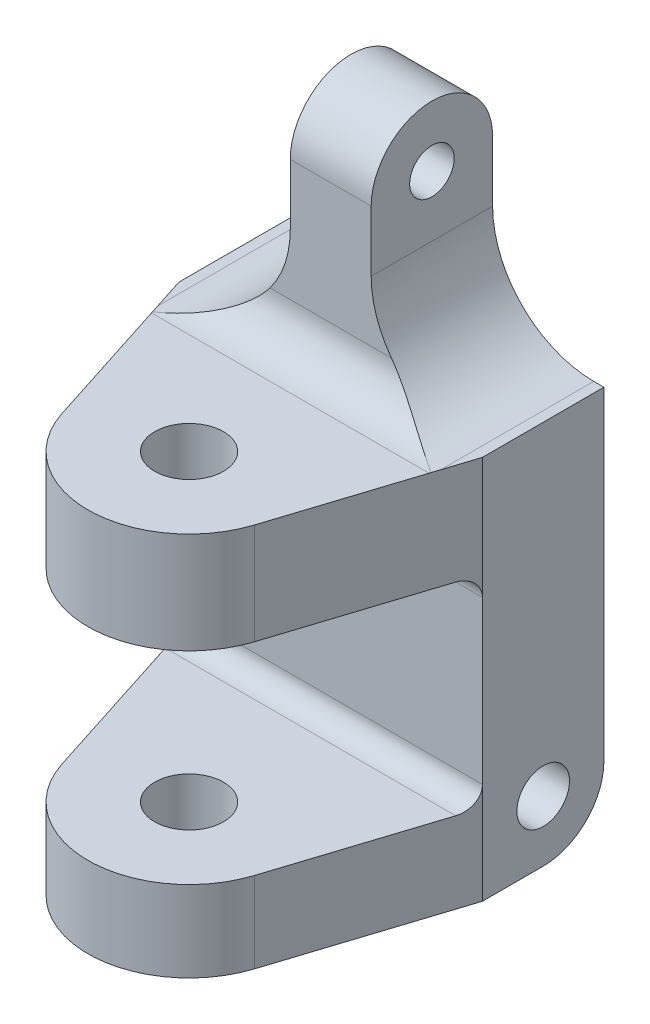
from build123d import *

# Parameters (mm, degrees)
BOSS_EXTRUDE1_DEPTH      = 9.525
BOSS_EXTRUDE6_DEPTH      = 15.24
BOSS_EXTRUDE6_DEPTH_BACK = 19.05
CUT_EXTRUDE1_DEPTH       = 29.575
CUT_EXTRUDE1_DEPTH_BACK  = 29.575
SKETCH9_R                = 1.397
SKETCH9_R_2              = 1.651
CUT_EXTRUDE2_DEPTH       = 33.995567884
SKETCH10_R               = 2.159
CUT_EXTRUDE3_DEPTH       = 33.18516778
CUT_EXTRUDE4_DEPTH       = 27.189420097
CUT_EXTRUDE4_DEPTH_BACK  = 27.189420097


with BuildPart() as part:
    # Sketch1 → Boss-Extrude1 (new, symmetric)
    with BuildSketch(Plane(origin=(0, 0, 0), x_dir=(0, 0, -1), z_dir=(1, 0, 0))):
        with BuildLine():
            Line((3.81, 15.24), (3.81, -15.24))
            ThreePointArc((3.81, -15.24), (0, -19.05), (-3.81, -15.24))
            Line((-3.81, -15.24), (-3.81, 15.24))
            ThreePointArc((-3.81, 15.24), (0, 19.05), (3.81, 15.24))
        make_face()
    extrude(amount=BOSS_EXTRUDE1_DEPTH, both=True)

    # Sketch7 → Boss-Extrude6 (add, two sides: drawn at the far end of the back side and taken through both)
    with BuildSketch(Plane(origin=(0, 0, 0), x_dir=(1, 0, 0), z_dir=(0, 1, 0)).offset(-BOSS_EXTRUDE6_DEPTH_BACK)):
        with BuildLine():
            Line((9.525, -3.81), (6.045782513, -14.641909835))
            ThreePointArc((6.045782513, -14.641909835), (3.741080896, -17.830966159), (0, -19.05))
            ThreePointArc((0, -19.05), (-3.741080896, -17.830966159), (-6.045782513, -14.641909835))
            Line((-6.045782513, -14.641909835), (-9.525, -3.81))
            Line((-9.525, -3.81), (-9.525, 0))
            Line((-9.525, 0), (9.525, 0))
            Line((9.525, 0), (9.525, -3.81))
        make_face()
    extrude(amount=BOSS_EXTRUDE6_DEPTH + BOSS_EXTRUDE6_DEPTH_BACK)

    # Sketch8 → Cut-Extrude1 (cut, two sides: drawn at the far end of the back side and taken through both)
    with BuildSketch(Plane(origin=(0, 0, 0), x_dir=(0, 0, -1), z_dir=(1, 0, 0)).offset(-CUT_EXTRUDE1_DEPTH_BACK)):
        with BuildLine():
            Line((-38.102695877, -13.97), (-5.08, -13.97))
            ThreePointArc((-5.08, -13.97), (-4.181974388, -13.598025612), (-3.81, -12.7))
            Line((-3.81, -12.7), (-3.81, -2.54))
            ThreePointArc((-3.81, -2.54), (-4.181974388, -1.641974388), (-5.08, -1.27))
            Line((-5.08, -1.27), (-38.102695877, -1.27))
            Line((-38.102695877, -1.27), (-38.102695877, -13.97))
        make_face()
        with BuildLine():
            Line((-38.102695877, 5.08), (-6.35, 5.08))
            ThreePointArc((-6.35, 5.08), (-4.553948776, 5.823948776), (-3.81, 7.62))
            Line((-3.81, 7.62), (-3.81, 18.584898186))
            Line((-3.81, 18.584898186), (-38.102695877, 18.584898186))
            Line((-38.102695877, 18.584898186), (-38.102695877, 5.08))
        make_face()
    extrude(amount=CUT_EXTRUDE1_DEPTH + CUT_EXTRUDE1_DEPTH_BACK, mode=Mode.SUBTRACT)

    # Sketch9 → Cut-Extrude2 (cut, through all)
    with BuildSketch(Plane.ZY.offset(9.525)):
        with Locations((0, 15.24)):
            Circle(SKETCH9_R)
        with Locations((0, -15.24)):
            Circle(SKETCH9_R_2)
    extrude(amount=-CUT_EXTRUDE2_DEPTH, mode=Mode.SUBTRACT)

    # Sketch10 → Cut-Extrude3 (cut, through all)
    with BuildSketch(Plane(origin=(0, 5.08, 0), x_dir=(1, 0, 0), z_dir=(0, 1, 0))):
        with Locations(Location((0, -12.7, 0), (0, 0, 270))):
            Circle(SKETCH10_R)
    extrude(amount=-CUT_EXTRUDE3_DEPTH, mode=Mode.SUBTRACT)

    # Sketch13 → Cut-Extrude4 (cut, two sides: drawn at the far end of the back side and taken through both)
    with BuildSketch(Plane.XY.offset(3.81).offset(-CUT_EXTRUDE4_DEPTH_BACK)):
        with BuildLine():
            Line((-2.54, 19.05), (-2.54, 11.43))
            ThreePointArc((-2.54, 11.43), (-4.399871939, 6.939871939), (-8.89, 5.08))
            Line((-8.89, 5.08), (-10.957716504, 5.08))
            Line((-10.957716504, 5.08), (-10.957716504, 19.05))
            Line((-10.957716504, 19.05), (-2.54, 19.05))
        make_face()
        with BuildLine():
            Line((10.957716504, 19.05), (2.54, 19.05))
            Line((2.54, 19.05), (2.54, 11.43))
            ThreePointArc((2.54, 11.43), (4.399871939, 6.939871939), (8.89, 5.08))
            Line((8.89, 5.08), (10.957716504, 5.08))
            Line((10.957716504, 5.08), (10.957716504, 19.05))
        make_face()
    extrude(amount=CUT_EXTRUDE4_DEPTH + CUT_EXTRUDE4_DEPTH_BACK, mode=Mode.SUBTRACT)


solid = part.part
